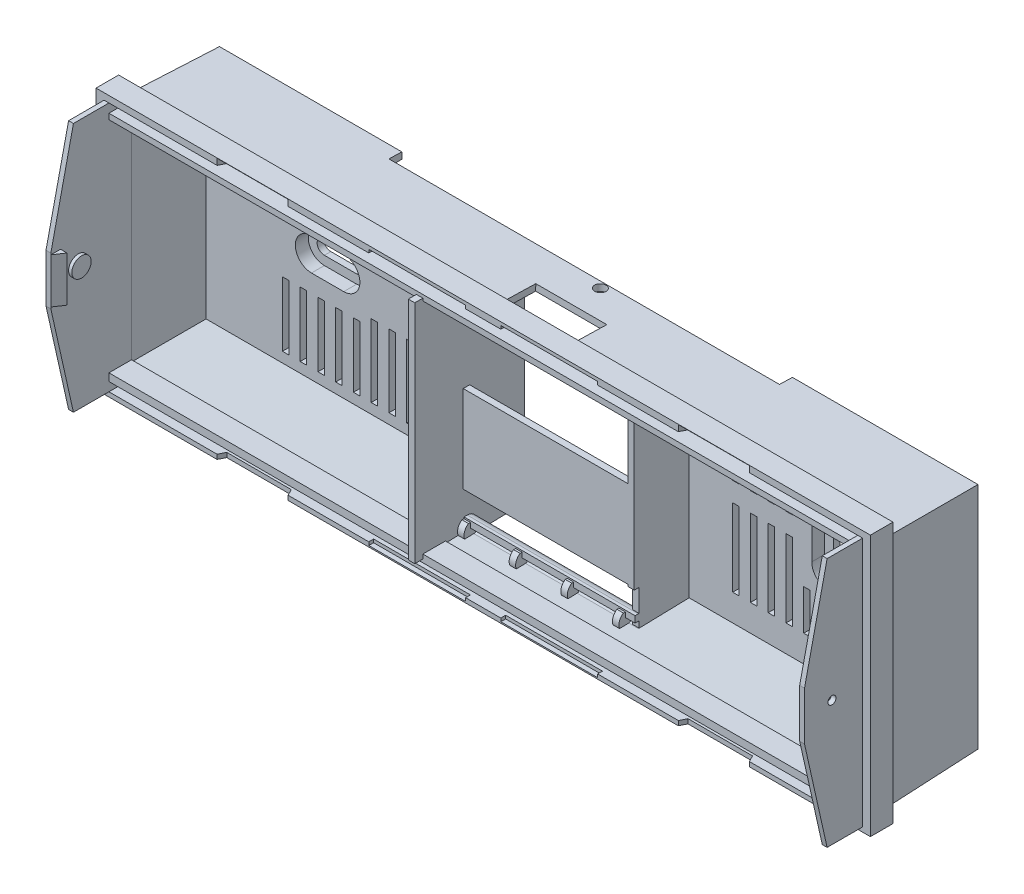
from build123d import *

# Parameters (mm, degrees)
ESQUISSE1_W                = 235
ESQUISSE1_H                = 71
EXTRUSION1_DEPTH           = 1.5
EXTRUSION2_START           = 4
ESQUISSE2_W                = 235
ESQUISSE2_H                = 71
EXTRUSION2_DEPTH           = 28.5
EXTRUSION2_DRAFT           = 1.5
ESQUISSE3_W                = 232.49259753
ESQUISSE3_H                = 68.49259753
ENL_V_MAT_EXTRU_1_DEPTH    = 22.5
ENL_V_MAT_EXTRU_1_DRAFT    = -1.5
ESQUISSE4_W                = 231
ESQUISSE4_H                = 67
ENL_V_MAT_EXTRU_2_DEPTH    = 4
ESQUISSE5_W                = 121
ESQUISSE5_H                = 4
ENL_V_MAT_EXTRU_3_DEPTH    = 40
ESQUISSE6_W                = 51
ESQUISSE6_H                = 69.851042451
ENL_V_MAT_EXTRU_4_DEPTH    = 17
ESQUISSE7_R                = 1.75
ESQUISSE7_W                = 22
ESQUISSE7_H                = 10.5
ENL_V_MAT_EXTRU_5_DEPTH    = 10
EXTRUSION3_DEPTH           = 4
ENL_V_START                = -2
ENL_V_MAT_EXTRU_6_DEPTH    = 10
ENL_V_MAT_EXTRU_7_DEPTH    = 10
ESQUISSE11_W               = 2
ESQUISSE11_H               = 70
EXTRUSION4_DEPTH           = 17
ESQUISSE12_W               = 2
ESQUISSE12_H               = 70
EXTRUSION5_DEPTH           = 32
EXTRUSION6_REACH           = 160.252
ESQUISSE13_W               = 2
ESQUISSE13_H               = 27
ENL_V_MAT_EXTRU_8_DEPTH    = 10
EXTRUSION7_REACH           = 147.967
EXTRUSION8_DEPTH           = 2
R_P_TITION_LIN_AIRE1_COUNT = 4
R_P_TITION_LIN_AIRE1_PITCH = 16
ESQUISSE17_W               = 239.903414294
ESQUISSE17_H               = 80.903414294
ESQUISSE17_W_2             = 231.903414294
ESQUISSE17_H_2             = 67.903414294
EXTRUSION9_DEPTH           = 7
ESQUISSE18_W               = 231.903414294
ESQUISSE18_H               = 2.75
ENL_V_MAT_EXTRU_9_DEPTH    = 5
ENL_V_START_2              = -2.5
ENL_V_MAT_EXTRU_10_DEPTH   = 3
ESQUISSE20_W               = 30
ESQUISSE20_H               = 1
ENL_V_MAT_EXTRU_11_DEPTH   = 1.5
EXTRUSION11_DEPTH          = 1.5
EXTRUSION12_DEPTH          = 7
ESQUISSE26_R               = 1.25
ENL_V_MAT_EXTRU_13_DEPTH   = 4
ESQUISSE27_R               = 3
EXTRUSION14_DEPTH          = 1
ESQUISSE28_W               = 2
ESQUISSE28_H               = 20
ENL_V_MAT_EXTRU_14_DEPTH   = 143.039202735
ESQUISSE29_W               = 2
ESQUISSE29_H               = 22.5
ENL_V_MAT_EXTRU_15_DEPTH   = 143.039202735
ESQUISSE30_W               = 2
ESQUISSE30_H               = 20
ENL_V_MAT_EXTRU_16_DEPTH   = 143.039202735
ESQUISSE31_W               = 2
ESQUISSE31_H               = 24
ENL_V_MAT_EXTRU_17_DEPTH   = 143.039202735
ESQUISSE32_W               = 2
ESQUISSE32_H               = 24
ENL_V_MAT_EXTRU_18_DEPTH   = 143.039202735
ESQUISSE33_W               = 2
ESQUISSE33_H               = 15
ENL_V_MAT_EXTRU_19_DEPTH   = 143.039202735
ESQUISSE34_W               = 2
ESQUISSE34_H               = 24
ENL_V_MAT_EXTRU_20_DEPTH   = 143.039202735
ESQUISSE35_W               = 2
ESQUISSE35_H               = 12.5
ENL_V_MAT_EXTRU_21_DEPTH   = 143.039202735
ESQUISSE36_W               = 2
ESQUISSE36_H               = 10
ENL_V_MAT_EXTRU_22_DEPTH   = 143.039202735
ESQUISSE37_W               = 2
ESQUISSE37_H               = 24
ENL_V_MAT_EXTRU_23_DEPTH   = 143.039202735


with BuildPart() as part:
    # Esquisse1 → Extrusion1 (new body)
    with BuildSketch(Plane.XY):
        with Locations((-6.5, 0)):
            Rectangle(ESQUISSE1_W, ESQUISSE1_H)
    extrude(amount=EXTRUSION1_DEPTH)


with BuildPart() as extrusion2_tool:
    # Esquisse2 → Extrusion2 (with draft: the straight prism first)
    with BuildSketch(Plane(origin=(0, 0, 0), x_dir=(-1, 0, 0), z_dir=(0, 0, -1)).offset(EXTRUSION2_START)):
        with Locations((6.5, 0)):
            Rectangle(ESQUISSE2_W, ESQUISSE2_H)
    extrude(amount=-EXTRUSION2_DEPTH)
    # Extrusion2: the draft: its side faces are tilted about the plane it starts from
    extrusion2_sides = [extrusion2_tool.faces().sort_by_distance(p)[0] for p in [
        (111, 0, 10.25),
        (-6.5, -35.5, 10.25),
        (-124, 0, 10.25),
        (-6.5, 35.5, 10.25),
    ]]
    draft(extrusion2_sides, Plane(origin=(0, 0, 0), x_dir=(-1, 0, 0), z_dir=(0, 0, -1)).offset(EXTRUSION2_START), EXTRUSION2_DRAFT)


with BuildPart() as part_1:
    add(part.part)

    # Extrusion2: add extrusion2_tool
    add(extrusion2_tool.part)


with BuildPart() as enl_v_mat_extru_1_tool:
    # Esquisse3 → Enl_v. mat.-Extru.1 (with draft: the straight prism first)
    with BuildSketch(Plane.XY.offset(24.5)):
        with Locations((-6.5, 0)):
            Rectangle(ESQUISSE3_W, ESQUISSE3_H)
    extrude(amount=-ENL_V_MAT_EXTRU_1_DEPTH)
    # Enl_v. mat.-Extru.1: the draft: its side faces are tilted about the plane it starts from
    enl_v_mat_extru_1_sides = [enl_v_mat_extru_1_tool.faces().sort_by_distance(p)[0] for p in [
        (-122.746298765, 0, 13.25),
        (-6.5, -34.246298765, 13.25),
        (109.746298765, 0, 13.25),
        (-6.5, 34.246298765, 13.25),
    ]]
    draft(enl_v_mat_extru_1_sides, Plane.XY.offset(24.5), ENL_V_MAT_EXTRU_1_DRAFT)


with BuildPart() as part_2:
    add(part_1.part)

    # Enl_v. mat.-Extru.1: cut by enl_v_mat_extru_1_tool
    add(enl_v_mat_extru_1_tool.part, mode=Mode.SUBTRACT)

    # Esquisse4 → Enl_v. mat.-Extru.2 (cut)
    with BuildSketch(Plane(origin=(0, 0, -4), x_dir=(-1, 0, 0), z_dir=(0, 0, -1))):
        with Locations((6.5, 0)):
            Rectangle(ESQUISSE4_W, ESQUISSE4_H)
    extrude(amount=-ENL_V_MAT_EXTRU_2_DEPTH, mode=Mode.SUBTRACT)

    # Esquisse5 → Enl_v. mat.-Extru.3 (cut, symmetric)
    with BuildSketch(Plane(origin=(0, 0, 0), x_dir=(1, 0, 0), z_dir=(0, 1, 0))):
        with Locations((-7, 2)):
            Rectangle(ESQUISSE5_W, ESQUISSE5_H)
    extrude(amount=ENL_V_MAT_EXTRU_3_DEPTH, both=True, mode=Mode.SUBTRACT)

    # Esquisse6 → Enl_v. mat.-Extru.4 (cut)
    with BuildSketch(Plane(origin=(0, 0, 0), x_dir=(-1, 0, 0), z_dir=(0, 0, -1))):
        with Locations((0, -1.320777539)):
            Rectangle(ESQUISSE6_W, ESQUISSE6_H)
    extrude(amount=-ENL_V_MAT_EXTRU_4_DEPTH, mode=Mode.SUBTRACT)

    # Esquisse7 → Enl_v. mat.-Extru.5 (cut)
    with BuildSketch(Plane(origin=(0, 35.580346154, -0.931704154), x_dir=(-1, 0, 0), z_dir=(0, 0.9996573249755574, -0.02617694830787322))):
        with Locations(Location((0, 2.932023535, 0), (0, 0, 90))):
            Circle(ESQUISSE7_R)
        with Locations((0, 17.182023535)):
            Rectangle(ESQUISSE7_W, ESQUISSE7_H)
    extrude(amount=-ENL_V_MAT_EXTRU_5_DEPTH, mode=Mode.SUBTRACT)

    # Esquisse8 → Extrusion3 (add)
    with BuildSketch(Plane(origin=(0, 0, 0), x_dir=(-1, 0, 0), z_dir=(0, 0, -1))):
        with BuildLine():
            Line((-78.5, 5), (-78.5, -5))
            ThreePointArc((-78.5, -5), (-70.5, -13), (-62.5, -5))
            Line((-62.5, -5), (-62.5, 5))
            ThreePointArc((-62.5, 5), (-70.5, 13), (-78.5, 5))
        make_face()
        with BuildLine():
            Line((79.5, 8), (89.5, 8))
            ThreePointArc((89.5, 8), (97.5, 0), (89.5, -8))
            Line((89.5, -8), (79.5, -8))
            ThreePointArc((79.5, -8), (71.5, 0), (79.5, 8))
        make_face()
    extrude(amount=EXTRUSION3_DEPTH)

    # Esquisse9 → Enl_v. mat.-Extru.6 (cut)
    with BuildSketch(Plane(origin=(81.698742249, 0.352113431, -4), x_dir=(-1, 0, 0), z_dir=(0, 0, -1)).offset(ENL_V_START)):
        with BuildLine():
            Line((161.198742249, 4.647886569), (171.198742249, 4.647886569))
            ThreePointArc((171.198742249, 4.647886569), (176.198742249, -0.352113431), (171.198742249, -5.352113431))
            Line((171.198742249, -5.352113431), (161.198742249, -5.352113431))
            ThreePointArc((161.198742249, -5.352113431), (156.198742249, -0.352113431), (161.198742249, 4.647886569))
        make_face()
        with BuildLine():
            Line((6.198742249, 4.647886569), (6.198742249, -5.352113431))
            ThreePointArc((6.198742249, -5.352113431), (11.198742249, -10.352113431), (16.198742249, -5.352113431))
            Line((16.198742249, -5.352113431), (16.198742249, 4.647886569))
            ThreePointArc((16.198742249, 4.647886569), (11.198742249, 9.647886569), (6.198742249, 4.647886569))
        make_face()
    extrude(amount=-ENL_V_MAT_EXTRU_6_DEPTH, mode=Mode.SUBTRACT)

    # Esquisse10 → Enl_v. mat.-Extru.7 (cut)
    with BuildSketch(Plane(origin=(0, 0, -4), x_dir=(-1, 0, 0), z_dir=(0, 0, -1))):
        with BuildLine():
            Line((-72.75, 5), (-72.75, -5))
            ThreePointArc((-72.75, -5), (-70.5, -7.25), (-68.25, -5))
            Line((-68.25, -5), (-68.25, 5))
            ThreePointArc((-68.25, 5), (-70.5, 7.25), (-72.75, 5))
        make_face()
        with BuildLine():
            Line((79.5, 2.25), (89.5, 2.25))
            ThreePointArc((89.5, 2.25), (91.75, 0), (89.5, -2.25))
            Line((89.5, -2.25), (79.5, -2.25))
            ThreePointArc((79.5, -2.25), (77.25, 0), (79.5, 2.25))
        make_face()
    extrude(amount=-ENL_V_MAT_EXTRU_7_DEPTH, mode=Mode.SUBTRACT)

    # Esquisse11 → Extrusion4 (add)
    with BuildSketch(Plane.XY.offset(2)):
        with Locations((26.5, 0)):
            Rectangle(ESQUISSE11_W, ESQUISSE11_H)
    extrude(amount=EXTRUSION4_DEPTH)

    # Esquisse12 → Extrusion5 (add)
    with BuildSketch(Plane.XY.offset(2)):
        with Locations((-26.5, 0)):
            Rectangle(ESQUISSE12_W, ESQUISSE12_H)
    extrude(amount=EXTRUSION5_DEPTH)

    # Esquisse13 → Extrusion6 (add, up to next)
    with BuildSketch(Plane.ZY.offset(-25.5), mode=Mode.PRIVATE) as extrusion6_sk1:
        with Locations((18, -9)):
            Rectangle(ESQUISSE13_W, ESQUISSE13_H)
    extrusion6_tool1 = extrude(extrusion6_sk1.sketch, amount=EXTRUSION6_REACH, mode=Mode.PRIVATE) - part_2.part
    add(extrusion6_tool1.solids().sort_by_distance((25.5, -9, 18))[0])

    # Esquisse15 → Enl_v. mat.-Extru.8 (cut)
    with BuildSketch(Plane(origin=(27.5, 0, 0), x_dir=(0, 0, -1), z_dir=(1, 0, 0))):
        Polygon((-17.5, -34.062997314), (-19, -34.102276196), (-19, -23.102276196), (-17.5, -23.102276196), align=None)
    extrude(amount=-ENL_V_MAT_EXTRU_8_DEPTH, mode=Mode.SUBTRACT)

    # Extrusion7: up to this face of the body (flat: up to its plane)
    extrusion7_end = Plane(part_2.part.faces().sort_by_distance((27.5, 0.414758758, 10.406457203))[0])
    # Esquisse14 → Extrusion7 (add, up to the picked face)
    with BuildSketch(Plane(origin=(-25.5, 0, 0), x_dir=(0, 0, -1), z_dir=(1, 0, 0)), mode=Mode.PRIVATE) as extrusion7_sk1:
        with BuildLine():
            Line((-17.75, -34.069543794), (-17.75, -36.069543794))
            ThreePointArc((-17.75, -36.069543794), (-14.75, -33.069543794), (-17.75, -30.069543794))
            Line((-17.75, -30.069543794), (-18.75, -30.069543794))
            Line((-18.75, -30.069543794), (-18.75, -32.069543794))
            Line((-18.75, -32.069543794), (-17.75, -32.069543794))
            ThreePointArc((-17.75, -32.069543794), (-16.75, -33.069543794), (-17.75, -34.069543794))
        make_face()
    extrusion7_tool1 = split(extrude(extrusion7_sk1.sketch, amount=EXTRUSION7_REACH, mode=Mode.PRIVATE), bisect_by=extrusion7_end, keep=Keep.BOTH, mode=Mode.PRIVATE)
    add(extrusion7_tool1.solids().sort_by(Axis((-25.5, -32.794939, 16.628696), (1, 0, 0)))[0])

    # Esquisse16 → Extrusion8 (add)
    with BuildSketch(Plane(origin=(-25.5, 0, 0), x_dir=(0, 0, -1), z_dir=(1, 0, 0))):
        with BuildLine():
            Line((-20.364376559, -34.540949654), (-16.364376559, -34.540949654))
            Line((-16.364376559, -34.540949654), (-16.364376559, -30.540949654))
            Line((-16.364376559, -30.540949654), (-19.364376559, -30.540949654))
            ThreePointArc((-19.364376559, -30.540949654), (-20.6604275, -32.341936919), (-20.364376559, -34.540949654))
        make_face()
    extrusion8 = extrude(amount=EXTRUSION8_DEPTH)

    # R_p_tition lin_aire1: Extrusion8 ×4
    with Locations(*[(i * R_P_TITION_LIN_AIRE1_PITCH, 0, 0) for i in range(1, R_P_TITION_LIN_AIRE1_COUNT)]):
        add(extrusion8)

    # Esquisse17 → Extrusion9 (add)
    with BuildSketch(Plane.XY.offset(24.5)):
        with Locations((-6.794591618, 0.294591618)):
            Rectangle(ESQUISSE17_W, ESQUISSE17_H)
        with Locations((-6.794591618, 0.294591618)):
            Rectangle(ESQUISSE17_W_2, ESQUISSE17_H_2, mode=Mode.SUBTRACT)
    extrude(amount=EXTRUSION9_DEPTH)

    # Esquisse18 → Enl_v. mat.-Extru.9 (cut)
    with BuildSketch(Plane.XY.offset(31.5)):
        with Locations((-6.794591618, 37.371298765)):
            Rectangle(ESQUISSE18_W, ESQUISSE18_H)
        with Locations((-6.794591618, -37.371298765)):
            Rectangle(ESQUISSE18_W, ESQUISSE18_H)
    extrude(amount=-ENL_V_MAT_EXTRU_9_DEPTH, mode=Mode.SUBTRACT)

    # Esquisse19 → Enl_v. mat.-Extru.10 (cut)
    with BuildSketch(Plane.XZ.offset(40.157115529).offset(ENL_V_START_2)):
        Polygon((-67.246298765, 31.5), (-89.246298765, 31.5), (-88.246298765, 29.5), (-68.246298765, 29.5), align=None)
        Polygon((74.657115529, 29.5), (75.657115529, 31.5), (53.657115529, 31.5), (54.657115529, 29.5), align=None)
    enl_v_mat_extru_10 = extrude(amount=ENL_V_MAT_EXTRU_10_DEPTH, mode=Mode.SUBTRACT)

    # Esquisse20 → Enl_v. mat.-Extru.11 (cut)
    with BuildSketch(Plane.XY.offset(31.5)):
        with Locations((-27.246298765, -39.246298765)):
            Rectangle(ESQUISSE20_W, ESQUISSE20_H)
        with Locations((13.657115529, -39.246298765)):
            Rectangle(ESQUISSE20_W, ESQUISSE20_H)
    enl_v_mat_extru_11 = extrude(amount=-ENL_V_MAT_EXTRU_11_DEPTH, mode=Mode.SUBTRACT)

    # Sym_trie1: Enl_v. mat.-Extru.10, Enl_v. mat.-Extru.11 across plane
    add(enl_v_mat_extru_10.mirror(Plane.ZX), mode=Mode.SUBTRACT)
    add(enl_v_mat_extru_11.mirror(Plane.ZX), mode=Mode.SUBTRACT)

    # Esquisse22 → Extrusion11 (add)
    with BuildSketch(Plane(origin=(-122.746298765, 0, 0), x_dir=(0, 0, -1), z_dir=(1, 0, 0))):
        Polygon((-31.5, -38.746298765), (-42.5, -38.746298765), (-49.5, -7.501298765), (-49.5, 7.498701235), (-42.5, 38.746298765), (-31.5, 38.746298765), align=None)
    extrusion11 = extrude(amount=-EXTRUSION11_DEPTH)

    # Esquisse23 → Extrusion12 (add, symmetric)
    with BuildSketch(Plane(origin=(0, 0, 0), x_dir=(1, 0, 0), z_dir=(0, 1, 0))):
        Polygon((-122.746298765, -49.5), (-120.746298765, -46.5), (-122.746298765, -46.5), align=None)
    extrusion12 = extrude(amount=EXTRUSION12_DEPTH, both=True)

    # Esquisse26 → Enl_v. mat.-Extru.13 (cut)
    with BuildSketch(Plane.ZY.offset(124.246298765)):
        with Locations(Location((41.000000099, 0, 0), (0, 0, 270))):
            Circle(ESQUISSE26_R)
    enl_v_mat_extru_13 = extrude(amount=-ENL_V_MAT_EXTRU_13_DEPTH, mode=Mode.SUBTRACT)

    # Esquisse27 → Extrusion14 (add)
    with BuildSketch(Plane(origin=(-122.746298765, 0, 0), x_dir=(0, 0, -1), z_dir=(1, 0, 0))):
        with Locations(Location((-41.000000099, 0, 0), (0, 0, 90))):
            Circle(ESQUISSE27_R)
    extrusion14 = extrude(amount=EXTRUSION14_DEPTH)

    # Sym_trie3: Extrusion11, Extrusion12, Enl_v. mat.-Extru.13, Extrusion14 across plane
    add(extrusion11.mirror(Plane.ZY.offset(6.746298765)))
    add(extrusion12.mirror(Plane.ZY.offset(6.746298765)))
    add(enl_v_mat_extru_13.mirror(Plane.ZY.offset(6.746298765)), mode=Mode.SUBTRACT)
    add(extrusion14.mirror(Plane.ZY.offset(6.746298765)))

    # Esquisse28 → Enl_v. mat.-Extru.14 (cut, through all)
    with BuildSketch(Plane(origin=(0, 0, 0), x_dir=(-1, 0, 0), z_dir=(0, 0, -1))):
        with Locations((53.5, 18)):
            Rectangle(ESQUISSE28_W, ESQUISSE28_H)
        with Locations((59, 18)):
            Rectangle(ESQUISSE28_W, ESQUISSE28_H)
        with Locations((64.5, 18)):
            Rectangle(ESQUISSE28_W, ESQUISSE28_H)
        with Locations((70, 18)):
            Rectangle(ESQUISSE28_W, ESQUISSE28_H)
        with Locations((75.5, 18)):
            Rectangle(ESQUISSE28_W, ESQUISSE28_H)
        with Locations((81, 18)):
            Rectangle(ESQUISSE28_W, ESQUISSE28_H)
        with Locations((86.5, 18)):
            Rectangle(ESQUISSE28_W, ESQUISSE28_H)
        with Locations((92, 18)):
            Rectangle(ESQUISSE28_W, ESQUISSE28_H)
        with Locations((97.5, 18)):
            Rectangle(ESQUISSE28_W, ESQUISSE28_H)
    extrude(amount=-ENL_V_MAT_EXTRU_14_DEPTH, mode=Mode.SUBTRACT)

    # Esquisse29 → Enl_v. mat.-Extru.15 (cut, through all)
    with BuildSketch(Plane(origin=(0, 0, 0), x_dir=(-1, 0, 0), z_dir=(0, 0, -1))):
        with Locations((53.5, -19.25)):
            Rectangle(ESQUISSE29_W, ESQUISSE29_H)
        with Locations((59, -19.25)):
            Rectangle(ESQUISSE29_W, ESQUISSE29_H)
        with Locations((64.5, -19.25)):
            Rectangle(ESQUISSE29_W, ESQUISSE29_H)
        with Locations((70, -19.25)):
            Rectangle(ESQUISSE29_W, ESQUISSE29_H)
    extrude(amount=-ENL_V_MAT_EXTRU_15_DEPTH, mode=Mode.SUBTRACT)

    # Esquisse30 → Enl_v. mat.-Extru.16 (cut, through all)
    with BuildSketch(Plane(origin=(0, 0, 0), x_dir=(-1, 0, 0), z_dir=(0, 0, -1))):
        with Locations((75.5, -20.5)):
            Rectangle(ESQUISSE30_W, ESQUISSE30_H)
        with Locations((81, -20.5)):
            Rectangle(ESQUISSE30_W, ESQUISSE30_H)
        with Locations((86.5, -20.5)):
            Rectangle(ESQUISSE30_W, ESQUISSE30_H)
        with Locations((92, -20.5)):
            Rectangle(ESQUISSE30_W, ESQUISSE30_H)
        with Locations((97.5, -20.5)):
            Rectangle(ESQUISSE30_W, ESQUISSE30_H)
    extrude(amount=-ENL_V_MAT_EXTRU_16_DEPTH, mode=Mode.SUBTRACT)

    # Esquisse31 → Enl_v. mat.-Extru.17 (cut, through all)
    with BuildSketch(Plane(origin=(0, 0, 0), x_dir=(-1, 0, 0), z_dir=(0, 0, -1))):
        with Locations((-42, 16.604743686)):
            Rectangle(ESQUISSE31_W, ESQUISSE31_H)
        with Locations((-47.5, 16.604743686)):
            Rectangle(ESQUISSE31_W, ESQUISSE31_H)
        with Locations((-53, 16.604743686)):
            Rectangle(ESQUISSE31_W, ESQUISSE31_H)
        with Locations((-58.5, 16.604743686)):
            Rectangle(ESQUISSE31_W, ESQUISSE31_H)
    extrude(amount=-ENL_V_MAT_EXTRU_17_DEPTH, mode=Mode.SUBTRACT)

    # Esquisse32 → Enl_v. mat.-Extru.18 (cut, through all)
    with BuildSketch(Plane(origin=(0, 0, 0), x_dir=(-1, 0, 0), z_dir=(0, 0, -1))):
        with Locations((-42, -13.395256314)):
            Rectangle(ESQUISSE32_W, ESQUISSE32_H)
        with Locations((-47.5, -13.395256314)):
            Rectangle(ESQUISSE32_W, ESQUISSE32_H)
        with Locations((-53, -13.395256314)):
            Rectangle(ESQUISSE32_W, ESQUISSE32_H)
        with Locations((-58.5, -13.395256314)):
            Rectangle(ESQUISSE32_W, ESQUISSE32_H)
    extrude(amount=-ENL_V_MAT_EXTRU_18_DEPTH, mode=Mode.SUBTRACT)

    # Esquisse33 → Enl_v. mat.-Extru.19 (cut, through all)
    with BuildSketch(Plane(origin=(0, 0, 0), x_dir=(-1, 0, 0), z_dir=(0, 0, -1))):
        with Locations((-64, 21.104743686)):
            Rectangle(ESQUISSE33_W, ESQUISSE33_H)
        with Locations((-69.5, 21.104743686)):
            Rectangle(ESQUISSE33_W, ESQUISSE33_H)
        with Locations((-75, 21.104743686)):
            Rectangle(ESQUISSE33_W, ESQUISSE33_H)
        with Locations((-80.5, 21.104743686)):
            Rectangle(ESQUISSE33_W, ESQUISSE33_H)
    extrude(amount=-ENL_V_MAT_EXTRU_19_DEPTH, mode=Mode.SUBTRACT)

    # Esquisse34 → Enl_v. mat.-Extru.20 (cut, through all)
    with BuildSketch(Plane(origin=(0, 0, 0), x_dir=(-1, 0, 0), z_dir=(0, 0, -1))):
        with Locations((-86, 16.604743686)):
            Rectangle(ESQUISSE34_W, ESQUISSE34_H)
    extrude(amount=-ENL_V_MAT_EXTRU_20_DEPTH, mode=Mode.SUBTRACT)

    # Esquisse35 → Enl_v. mat.-Extru.21 (cut, through all)
    with BuildSketch(Plane(origin=(0, 0, 0), x_dir=(-1, 0, 0), z_dir=(0, 0, -1))):
        with Locations((-64, -19.145256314)):
            Rectangle(ESQUISSE35_W, ESQUISSE35_H)
        with Locations((-80.5, -19.145256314)):
            Rectangle(ESQUISSE35_W, ESQUISSE35_H)
    extrude(amount=-ENL_V_MAT_EXTRU_21_DEPTH, mode=Mode.SUBTRACT)

    # Esquisse36 → Enl_v. mat.-Extru.22 (cut, through all)
    with BuildSketch(Plane(origin=(0, 0, 0), x_dir=(-1, 0, 0), z_dir=(0, 0, -1))):
        with Locations((-69.5, -20.395256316)):
            Rectangle(ESQUISSE36_W, ESQUISSE36_H)
        with Locations((-75, -20.395256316)):
            Rectangle(ESQUISSE36_W, ESQUISSE36_H)
    extrude(amount=-ENL_V_MAT_EXTRU_22_DEPTH, mode=Mode.SUBTRACT)

    # Esquisse37 → Enl_v. mat.-Extru.23 (cut, through all)
    with BuildSketch(Plane(origin=(0, 0, 0), x_dir=(-1, 0, 0), z_dir=(0, 0, -1))):
        with Locations((-86, -13.395256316)):
            Rectangle(ESQUISSE37_W, ESQUISSE37_H)
    extrude(amount=-ENL_V_MAT_EXTRU_23_DEPTH, mode=Mode.SUBTRACT)


solid = part_2.part
